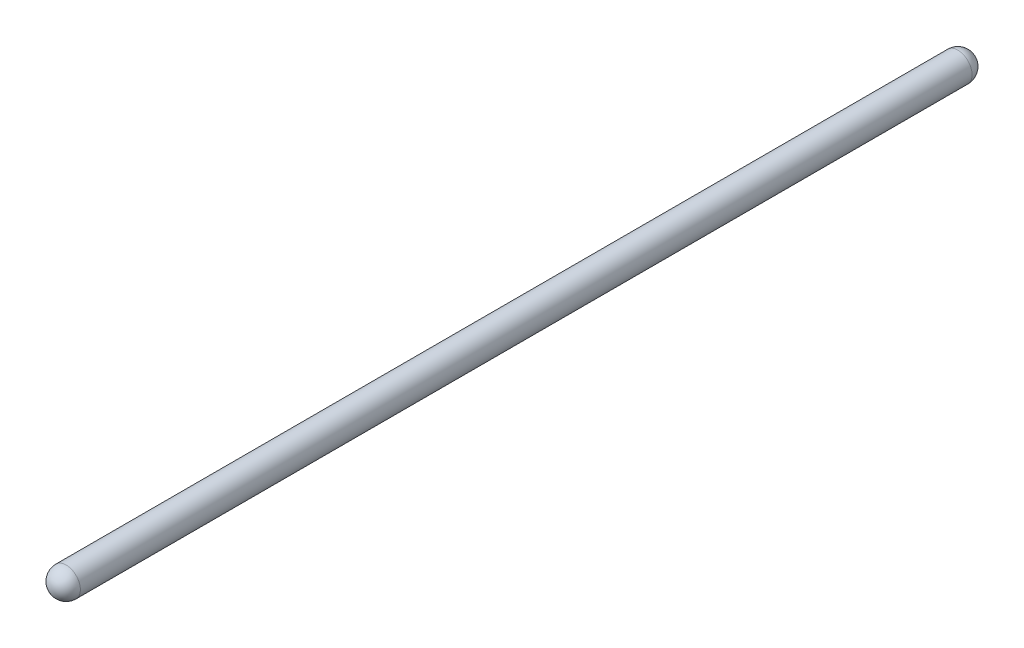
from build123d import *

# Parameters (mm, degrees)
ESQUISSE1_R        = 1
BOSS_EXTRU_1_DEPTH = 64.5
CONG_1_R           = 1


with BuildPart() as part:
    # Esquisse1 → Boss.-Extru.1 (new body)
    with BuildSketch(Plane.XY):
        Circle(ESQUISSE1_R)
    extrude(amount=BOSS_EXTRU_1_DEPTH)

    # Cong_1
    cong_1_edges = [part.edges().sort_by_distance(p)[0] for p in [
        (-1, 0, 0),
        (-1, 0, 64.5),
    ]]
    fillet(cong_1_edges, radius=CONG_1_R)


solid = part.part
